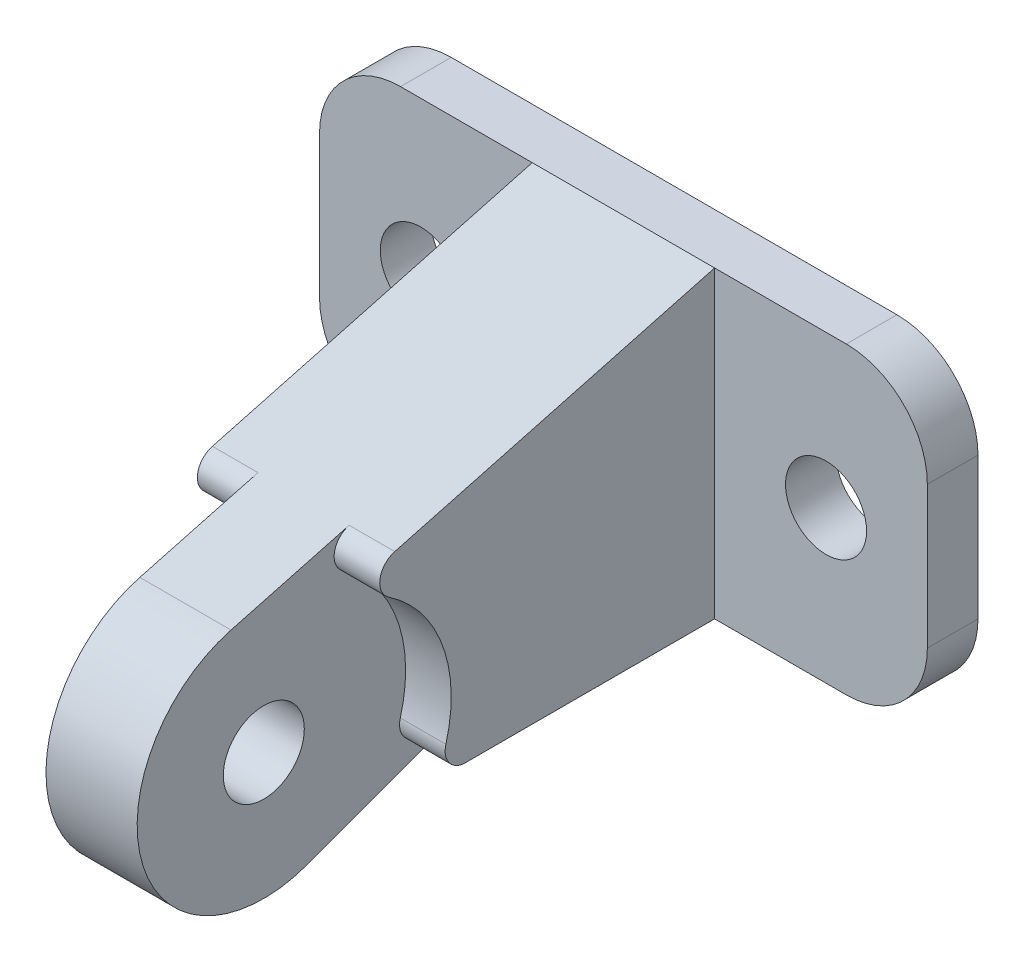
ISO-10303-21;
HEADER;
FILE_DESCRIPTION(('STEP AP214'),'2;1');
FILE_NAME('part.step','',(''),(''),'','','');
FILE_SCHEMA(('AUTOMOTIVE_DESIGN { 1 0 10303 214 1 1 1 1 }'));
ENDSEC;
DATA;
#1=APPLICATION_CONTEXT('core data for automotive mechanical design processes');
#2=APPLICATION_PROTOCOL_DEFINITION('international standard','automotive_design',2000,#1);
#3=PRODUCT_CONTEXT('',#1,'mechanical');
#4=PRODUCT('Part','Part','',(#3));
#5=PRODUCT_RELATED_PRODUCT_CATEGORY('part','',(#4));
#6=PRODUCT_DEFINITION_FORMATION('','',#4);
#7=PRODUCT_DEFINITION_CONTEXT('part definition',#1,'design');
#8=PRODUCT_DEFINITION('design','',#6,#7);
#9=PRODUCT_DEFINITION_SHAPE('','',#8);
#10=(LENGTH_UNIT() NAMED_UNIT(*) SI_UNIT(.MILLI.,.METRE.));
#11=(NAMED_UNIT(*) PLANE_ANGLE_UNIT() SI_UNIT($,.RADIAN.));
#12=(NAMED_UNIT(*) SI_UNIT($,.STERADIAN.) SOLID_ANGLE_UNIT());
#13=UNCERTAINTY_MEASURE_WITH_UNIT(LENGTH_MEASURE(1.E-05),#10,'distance_accuracy_value','');
#14=(GEOMETRIC_REPRESENTATION_CONTEXT(3) GLOBAL_UNCERTAINTY_ASSIGNED_CONTEXT((#13)) GLOBAL_UNIT_ASSIGNED_CONTEXT((#10,
#11,#12)) REPRESENTATION_CONTEXT('',''));
#15=CARTESIAN_POINT('',(0.,0.,0.));
#16=DIRECTION('',(0.,0.,1.));
#17=DIRECTION('',(1.,0.,0.));
#18=AXIS2_PLACEMENT_3D('',#15,#16,#17);
#19=CARTESIAN_POINT('',(22.,7.,5.));
#20=DIRECTION('',(0.,0.,-1.));
#21=DIRECTION('',(-1.,0.,0.));
#22=AXIS2_PLACEMENT_3D('',#19,#20,#21);
#23=PLANE('',#22);
#24=CARTESIAN_POINT('',(-20.,0.,5.));
#25=DIRECTION('',(0.,0.,1.));
#26=DIRECTION('',(1.,0.,0.));
#27=AXIS2_PLACEMENT_3D('',#24,#25,#26);
#28=CIRCLE('',#27,4.);
#29=CARTESIAN_POINT('',(-16.,0.,5.));
#30=VERTEX_POINT('',#29);
#31=EDGE_CURVE('E331',#30,#30,#28,.T.);
#32=ORIENTED_EDGE('',*,*,#31,.F.);
#33=EDGE_LOOP('',(#32));
#34=FACE_BOUND('',#33,.T.);
#35=DIRECTION('',(0.,-1.,0.));
#36=VECTOR('',#35,1.);
#37=CARTESIAN_POINT('',(-9.,0.,5.));
#38=LINE('',#37,#36);
#39=CARTESIAN_POINT('',(-9.,15.,5.));
#40=VERTEX_POINT('',#39);
#41=CARTESIAN_POINT('',(-9.,-15.,5.));
#42=VERTEX_POINT('',#41);
#43=EDGE_CURVE('E252',#40,#42,#38,.T.);
#44=ORIENTED_EDGE('',*,*,#43,.F.);
#45=DIRECTION('',(-1.,0.,0.));
#46=VECTOR('',#45,1.);
#47=CARTESIAN_POINT('',(-21.9999999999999,15.,5.));
#48=LINE('',#47,#46);
#49=CARTESIAN_POINT('',(-21.9999999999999,15.,5.));
#50=VERTEX_POINT('',#49);
#51=EDGE_CURVE('E343',#40,#50,#48,.T.);
#52=ORIENTED_EDGE('',*,*,#51,.T.);
#53=CARTESIAN_POINT('',(-22.,7.,5.));
#54=DIRECTION('',(0.,0.,1.));
#55=DIRECTION('',(-1.,0.,0.));
#56=AXIS2_PLACEMENT_3D('',#53,#54,#55);
#57=CIRCLE('',#56,8.);
#58=CARTESIAN_POINT('',(-30.,6.99999999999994,5.));
#59=VERTEX_POINT('',#58);
#60=EDGE_CURVE('E348',#50,#59,#57,.T.);
#61=ORIENTED_EDGE('',*,*,#60,.T.);
#62=DIRECTION('',(0.,-1.,0.));
#63=VECTOR('',#62,1.);
#64=CARTESIAN_POINT('',(-30.,-6.99999999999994,5.));
#65=LINE('',#64,#63);
#66=CARTESIAN_POINT('',(-30.,-6.99999999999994,5.));
#67=VERTEX_POINT('',#66);
#68=EDGE_CURVE('E351',#59,#67,#65,.T.);
#69=ORIENTED_EDGE('',*,*,#68,.T.);
#70=CARTESIAN_POINT('',(-22.,-7.,5.));
#71=DIRECTION('',(0.,0.,1.));
#72=DIRECTION('',(-1.,0.,0.));
#73=AXIS2_PLACEMENT_3D('',#70,#71,#72);
#74=CIRCLE('',#73,8.);
#75=CARTESIAN_POINT('',(-21.9999999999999,-15.,5.));
#76=VERTEX_POINT('',#75);
#77=EDGE_CURVE('E354',#67,#76,#74,.T.);
#78=ORIENTED_EDGE('',*,*,#77,.T.);
#79=DIRECTION('',(1.,0.,0.));
#80=VECTOR('',#79,1.);
#81=CARTESIAN_POINT('',(-21.9999999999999,-15.,5.));
#82=LINE('',#81,#80);
#83=EDGE_CURVE('E358',#76,#42,#82,.T.);
#84=ORIENTED_EDGE('',*,*,#83,.T.);
#85=EDGE_LOOP('',(#44,#52,#61,#69,#78,#84));
#86=FACE_BOUND('',#85,.T.);
#87=ADVANCED_FACE('F47',(#34,#86),#23,.F.);
#88=CARTESIAN_POINT('',(22.,15.,5.));
#89=VERTEX_POINT('',#88);
#90=CARTESIAN_POINT('',(9.,15.,5.));
#91=VERTEX_POINT('',#90);
#92=EDGE_CURVE('E345',#89,#91,#48,.T.);
#93=ORIENTED_EDGE('',*,*,#92,.T.);
#94=DIRECTION('',(0.,-1.,0.));
#95=VECTOR('',#94,1.);
#96=CARTESIAN_POINT('',(9.,0.,5.));
#97=LINE('',#96,#95);
#98=CARTESIAN_POINT('',(9.,-15.,5.));
#99=VERTEX_POINT('',#98);
#100=EDGE_CURVE('E70',#91,#99,#97,.T.);
#101=ORIENTED_EDGE('',*,*,#100,.T.);
#102=CARTESIAN_POINT('',(22.,-15.,5.));
#103=VERTEX_POINT('',#102);
#104=EDGE_CURVE('E357',#99,#103,#82,.T.);
#105=ORIENTED_EDGE('',*,*,#104,.T.);
#106=CARTESIAN_POINT('',(22.,-7.,5.));
#107=DIRECTION('',(0.,0.,1.));
#108=DIRECTION('',(-1.,0.,0.));
#109=AXIS2_PLACEMENT_3D('',#106,#107,#108);
#110=CIRCLE('',#109,8.);
#111=CARTESIAN_POINT('',(30.,-6.99999999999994,5.));
#112=VERTEX_POINT('',#111);
#113=EDGE_CURVE('E362',#103,#112,#110,.T.);
#114=ORIENTED_EDGE('',*,*,#113,.T.);
#115=DIRECTION('',(0.,1.,0.));
#116=VECTOR('',#115,1.);
#117=CARTESIAN_POINT('',(30.,-6.99999999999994,5.));
#118=LINE('',#117,#116);
#119=CARTESIAN_POINT('',(30.,6.99999999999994,5.));
#120=VERTEX_POINT('',#119);
#121=EDGE_CURVE('E365',#112,#120,#118,.T.);
#122=ORIENTED_EDGE('',*,*,#121,.T.);
#123=CARTESIAN_POINT('',(22.,7.,5.));
#124=DIRECTION('',(0.,0.,1.));
#125=DIRECTION('',(-1.,0.,0.));
#126=AXIS2_PLACEMENT_3D('',#123,#124,#125);
#127=CIRCLE('',#126,8.);
#128=EDGE_CURVE('E339',#120,#89,#127,.T.);
#129=ORIENTED_EDGE('',*,*,#128,.T.);
#130=EDGE_LOOP('',(#93,#101,#105,#114,#122,#129));
#131=FACE_BOUND('',#130,.T.);
#132=CARTESIAN_POINT('',(20.,0.,5.));
#133=DIRECTION('',(0.,0.,1.));
#134=DIRECTION('',(1.,0.,0.));
#135=AXIS2_PLACEMENT_3D('',#132,#133,#134);
#136=CIRCLE('',#135,4.);
#137=CARTESIAN_POINT('',(24.,0.,5.));
#138=VERTEX_POINT('',#137);
#139=EDGE_CURVE('E323',#138,#138,#136,.T.);
#140=ORIENTED_EDGE('',*,*,#139,.F.);
#141=EDGE_LOOP('',(#140));
#142=FACE_BOUND('',#141,.T.);
#143=ADVANCED_FACE('F515',(#131,#142),#23,.F.);
#144=CARTESIAN_POINT('',(22.,7.,0.));
#145=DIRECTION('',(0.,0.,-1.));
#146=DIRECTION('',(-1.,0.,0.));
#147=AXIS2_PLACEMENT_3D('',#144,#145,#146);
#148=PLANE('',#147);
#149=CARTESIAN_POINT('',(-20.,0.,0.));
#150=DIRECTION('',(0.,0.,1.));
#151=DIRECTION('',(1.,0.,0.));
#152=AXIS2_PLACEMENT_3D('',#149,#150,#151);
#153=CIRCLE('',#152,4.);
#154=CARTESIAN_POINT('',(-16.,0.,0.));
#155=VERTEX_POINT('',#154);
#156=EDGE_CURVE('E327',#155,#155,#153,.T.);
#157=ORIENTED_EDGE('',*,*,#156,.T.);
#158=EDGE_LOOP('',(#157));
#159=FACE_BOUND('',#158,.T.);
#160=CARTESIAN_POINT('',(22.,7.,0.));
#161=DIRECTION('',(0.,0.,1.));
#162=DIRECTION('',(-1.,0.,0.));
#163=AXIS2_PLACEMENT_3D('',#160,#161,#162);
#164=CIRCLE('',#163,8.);
#165=CARTESIAN_POINT('',(30.,6.99999999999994,0.));
#166=VERTEX_POINT('',#165);
#167=CARTESIAN_POINT('',(22.,15.,0.));
#168=VERTEX_POINT('',#167);
#169=EDGE_CURVE('E335',#166,#168,#164,.T.);
#170=ORIENTED_EDGE('',*,*,#169,.F.);
#171=DIRECTION('',(0.,1.,0.));
#172=VECTOR('',#171,1.);
#173=CARTESIAN_POINT('',(30.,-6.99999999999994,0.));
#174=LINE('',#173,#172);
#175=CARTESIAN_POINT('',(30.,-6.99999999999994,0.));
#176=VERTEX_POINT('',#175);
#177=EDGE_CURVE('E344',#176,#166,#174,.T.);
#178=ORIENTED_EDGE('',*,*,#177,.F.);
#179=CARTESIAN_POINT('',(22.,-7.,0.));
#180=DIRECTION('',(0.,0.,1.));
#181=DIRECTION('',(-1.,0.,0.));
#182=AXIS2_PLACEMENT_3D('',#179,#180,#181);
#183=CIRCLE('',#182,8.);
#184=CARTESIAN_POINT('',(22.,-15.,0.));
#185=VERTEX_POINT('',#184);
#186=EDGE_CURVE('E387',#185,#176,#183,.T.);
#187=ORIENTED_EDGE('',*,*,#186,.F.);
#188=DIRECTION('',(1.,0.,0.));
#189=VECTOR('',#188,1.);
#190=CARTESIAN_POINT('',(-21.9999999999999,-15.,0.));
#191=LINE('',#190,#189);
#192=CARTESIAN_POINT('',(-21.9999999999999,-15.,0.));
#193=VERTEX_POINT('',#192);
#194=EDGE_CURVE('E384',#193,#185,#191,.T.);
#195=ORIENTED_EDGE('',*,*,#194,.F.);
#196=CARTESIAN_POINT('',(-22.,-7.,0.));
#197=DIRECTION('',(0.,0.,1.));
#198=DIRECTION('',(-1.,0.,0.));
#199=AXIS2_PLACEMENT_3D('',#196,#197,#198);
#200=CIRCLE('',#199,8.);
#201=CARTESIAN_POINT('',(-30.,-6.99999999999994,0.));
#202=VERTEX_POINT('',#201);
#203=EDGE_CURVE('E381',#202,#193,#200,.T.);
#204=ORIENTED_EDGE('',*,*,#203,.F.);
#205=DIRECTION('',(0.,-1.,0.));
#206=VECTOR('',#205,1.);
#207=CARTESIAN_POINT('',(-30.,-6.99999999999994,0.));
#208=LINE('',#207,#206);
#209=CARTESIAN_POINT('',(-30.,6.99999999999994,0.));
#210=VERTEX_POINT('',#209);
#211=EDGE_CURVE('E378',#210,#202,#208,.T.);
#212=ORIENTED_EDGE('',*,*,#211,.F.);
#213=CARTESIAN_POINT('',(-22.,7.,0.));
#214=DIRECTION('',(0.,0.,1.));
#215=DIRECTION('',(-1.,0.,0.));
#216=AXIS2_PLACEMENT_3D('',#213,#214,#215);
#217=CIRCLE('',#216,8.);
#218=CARTESIAN_POINT('',(-21.9999999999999,15.,0.));
#219=VERTEX_POINT('',#218);
#220=EDGE_CURVE('E375',#219,#210,#217,.T.);
#221=ORIENTED_EDGE('',*,*,#220,.F.);
#222=DIRECTION('',(-1.,0.,0.));
#223=VECTOR('',#222,1.);
#224=CARTESIAN_POINT('',(-21.9999999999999,15.,0.));
#225=LINE('',#224,#223);
#226=EDGE_CURVE('E372',#168,#219,#225,.T.);
#227=ORIENTED_EDGE('',*,*,#226,.F.);
#228=EDGE_LOOP('',(#170,#178,#187,#195,#204,#212,#221,#227));
#229=FACE_BOUND('',#228,.T.);
#230=CARTESIAN_POINT('',(20.,0.,0.));
#231=DIRECTION('',(0.,0.,1.));
#232=DIRECTION('',(1.,0.,0.));
#233=AXIS2_PLACEMENT_3D('',#230,#231,#232);
#234=CIRCLE('',#233,4.);
#235=CARTESIAN_POINT('',(24.,0.,0.));
#236=VERTEX_POINT('',#235);
#237=EDGE_CURVE('E322',#236,#236,#234,.T.);
#238=ORIENTED_EDGE('',*,*,#237,.T.);
#239=EDGE_LOOP('',(#238));
#240=FACE_BOUND('',#239,.T.);
#241=ADVANCED_FACE('F504',(#159,#229,#240),#148,.T.);
#242=CARTESIAN_POINT('',(22.,7.,5.));
#243=DIRECTION('',(0.,0.,-1.));
#244=DIRECTION('',(-1.,0.,0.));
#245=AXIS2_PLACEMENT_3D('',#242,#243,#244);
#246=CYLINDRICAL_SURFACE('',#245,8.);
#247=ORIENTED_EDGE('',*,*,#169,.T.);
#248=DIRECTION('',(0.,0.,-1.));
#249=VECTOR('',#248,1.);
#250=CARTESIAN_POINT('',(22.,15.,5.));
#251=LINE('',#250,#249);
#252=EDGE_CURVE('E419',#89,#168,#251,.T.);
#253=ORIENTED_EDGE('',*,*,#252,.F.);
#254=ORIENTED_EDGE('',*,*,#128,.F.);
#255=DIRECTION('',(0.,0.,-1.));
#256=VECTOR('',#255,1.);
#257=CARTESIAN_POINT('',(30.,6.99999999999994,5.));
#258=LINE('',#257,#256);
#259=EDGE_CURVE('E368',#120,#166,#258,.T.);
#260=ORIENTED_EDGE('',*,*,#259,.T.);
#261=EDGE_LOOP('',(#247,#253,#254,#260));
#262=FACE_BOUND('',#261,.T.);
#263=ADVANCED_FACE('F49',(#262),#246,.T.);
#264=CARTESIAN_POINT('',(-21.9999999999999,15.,5.));
#265=DIRECTION('',(0.,-1.,0.));
#266=DIRECTION('',(0.,0.,-1.));
#267=AXIS2_PLACEMENT_3D('',#264,#265,#266);
#268=PLANE('',#267);
#269=ORIENTED_EDGE('',*,*,#226,.T.);
#270=DIRECTION('',(0.,0.,-1.));
#271=VECTOR('',#270,1.);
#272=CARTESIAN_POINT('',(-21.9999999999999,15.,5.));
#273=LINE('',#272,#271);
#274=EDGE_CURVE('E415',#50,#219,#273,.T.);
#275=ORIENTED_EDGE('',*,*,#274,.F.);
#276=ORIENTED_EDGE('',*,*,#51,.F.);
#277=EDGE_CURVE('E63',#91,#40,#48,.T.);
#278=ORIENTED_EDGE('',*,*,#277,.F.);
#279=ORIENTED_EDGE('',*,*,#92,.F.);
#280=ORIENTED_EDGE('',*,*,#252,.T.);
#281=EDGE_LOOP('',(#269,#275,#276,#278,#279,#280));
#282=FACE_BOUND('',#281,.T.);
#283=ADVANCED_FACE('F486',(#282),#268,.F.);
#284=CARTESIAN_POINT('',(-22.,7.,5.));
#285=DIRECTION('',(0.,0.,-1.));
#286=DIRECTION('',(-1.,0.,0.));
#287=AXIS2_PLACEMENT_3D('',#284,#285,#286);
#288=CYLINDRICAL_SURFACE('',#287,8.);
#289=ORIENTED_EDGE('',*,*,#220,.T.);
#290=DIRECTION('',(0.,0.,-1.));
#291=VECTOR('',#290,1.);
#292=CARTESIAN_POINT('',(-30.,6.99999999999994,5.));
#293=LINE('',#292,#291);
#294=EDGE_CURVE('E411',#59,#210,#293,.T.);
#295=ORIENTED_EDGE('',*,*,#294,.F.);
#296=ORIENTED_EDGE('',*,*,#60,.F.);
#297=ORIENTED_EDGE('',*,*,#274,.T.);
#298=EDGE_LOOP('',(#289,#295,#296,#297));
#299=FACE_BOUND('',#298,.T.);
#300=ADVANCED_FACE('F489',(#299),#288,.T.);
#301=CARTESIAN_POINT('',(-30.,-6.99999999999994,5.));
#302=DIRECTION('',(1.,0.,0.));
#303=DIRECTION('',(0.,0.,-1.));
#304=AXIS2_PLACEMENT_3D('',#301,#302,#303);
#305=PLANE('',#304);
#306=ORIENTED_EDGE('',*,*,#211,.T.);
#307=DIRECTION('',(0.,0.,-1.));
#308=VECTOR('',#307,1.);
#309=CARTESIAN_POINT('',(-30.,-6.99999999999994,5.));
#310=LINE('',#309,#308);
#311=EDGE_CURVE('E407',#67,#202,#310,.T.);
#312=ORIENTED_EDGE('',*,*,#311,.F.);
#313=ORIENTED_EDGE('',*,*,#68,.F.);
#314=ORIENTED_EDGE('',*,*,#294,.T.);
#315=EDGE_LOOP('',(#306,#312,#313,#314));
#316=FACE_BOUND('',#315,.T.);
#317=ADVANCED_FACE('F494',(#316),#305,.F.);
#318=CARTESIAN_POINT('',(-22.,-7.,5.));
#319=DIRECTION('',(0.,0.,-1.));
#320=DIRECTION('',(-1.,0.,0.));
#321=AXIS2_PLACEMENT_3D('',#318,#319,#320);
#322=CYLINDRICAL_SURFACE('',#321,8.);
#323=ORIENTED_EDGE('',*,*,#203,.T.);
#324=DIRECTION('',(0.,0.,-1.));
#325=VECTOR('',#324,1.);
#326=CARTESIAN_POINT('',(-21.9999999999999,-15.,5.));
#327=LINE('',#326,#325);
#328=EDGE_CURVE('E403',#76,#193,#327,.T.);
#329=ORIENTED_EDGE('',*,*,#328,.F.);
#330=ORIENTED_EDGE('',*,*,#77,.F.);
#331=ORIENTED_EDGE('',*,*,#311,.T.);
#332=EDGE_LOOP('',(#323,#329,#330,#331));
#333=FACE_BOUND('',#332,.T.);
#334=ADVANCED_FACE('F498',(#333),#322,.T.);
#335=CARTESIAN_POINT('',(-21.9999999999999,-15.,5.));
#336=DIRECTION('',(0.,1.,0.));
#337=DIRECTION('',(0.,0.,1.));
#338=AXIS2_PLACEMENT_3D('',#335,#336,#337);
#339=PLANE('',#338);
#340=ORIENTED_EDGE('',*,*,#104,.F.);
#341=DIRECTION('',(0.,0.,1.));
#342=VECTOR('',#341,1.);
#343=CARTESIAN_POINT('',(9.,-15.,0.));
#344=LINE('',#343,#342);
#345=CARTESIAN_POINT('',(9.,-15.,29.6001615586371));
#346=VERTEX_POINT('',#345);
#347=EDGE_CURVE('E225',#99,#346,#344,.T.);
#348=ORIENTED_EDGE('',*,*,#347,.T.);
#349=DIRECTION('',(-1.,0.,0.));
#350=VECTOR('',#349,1.);
#351=CARTESIAN_POINT('',(9.,-15.,29.6001615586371));
#352=LINE('',#351,#350);
#353=CARTESIAN_POINT('',(4.5,-15.,29.6001615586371));
#354=VERTEX_POINT('',#353);
#355=EDGE_CURVE('E263',#346,#354,#352,.T.);
#356=ORIENTED_EDGE('',*,*,#355,.T.);
#357=DIRECTION('',(0.,0.,-1.));
#358=VECTOR('',#357,1.);
#359=CARTESIAN_POINT('',(4.5,-15.,0.));
#360=LINE('',#359,#358);
#361=CARTESIAN_POINT('',(4.5,-15.,25.9137657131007));
#362=VERTEX_POINT('',#361);
#363=EDGE_CURVE('E203',#354,#362,#360,.T.);
#364=ORIENTED_EDGE('',*,*,#363,.T.);
#365=DIRECTION('',(-1.,0.,0.));
#366=VECTOR('',#365,1.);
#367=CARTESIAN_POINT('',(4.5,-15.,25.9137657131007));
#368=LINE('',#367,#366);
#369=CARTESIAN_POINT('',(-4.5,-15.,25.9137657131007));
#370=VERTEX_POINT('',#369);
#371=EDGE_CURVE('E298',#362,#370,#368,.T.);
#372=ORIENTED_EDGE('',*,*,#371,.T.);
#373=DIRECTION('',(0.,0.,-1.));
#374=VECTOR('',#373,1.);
#375=CARTESIAN_POINT('',(-4.5,-15.,0.));
#376=LINE('',#375,#374);
#377=CARTESIAN_POINT('',(-4.5,-15.,29.6001615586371));
#378=VERTEX_POINT('',#377);
#379=EDGE_CURVE('E423',#378,#370,#376,.T.);
#380=ORIENTED_EDGE('',*,*,#379,.F.);
#381=CARTESIAN_POINT('',(-9.,-15.,29.6001615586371));
#382=VERTEX_POINT('',#381);
#383=EDGE_CURVE('E262',#378,#382,#352,.T.);
#384=ORIENTED_EDGE('',*,*,#383,.T.);
#385=DIRECTION('',(0.,0.,1.));
#386=VECTOR('',#385,1.);
#387=CARTESIAN_POINT('',(-9.,-15.,0.));
#388=LINE('',#387,#386);
#389=EDGE_CURVE('E248',#42,#382,#388,.T.);
#390=ORIENTED_EDGE('',*,*,#389,.F.);
#391=ORIENTED_EDGE('',*,*,#83,.F.);
#392=ORIENTED_EDGE('',*,*,#328,.T.);
#393=ORIENTED_EDGE('',*,*,#194,.T.);
#394=DIRECTION('',(0.,0.,-1.));
#395=VECTOR('',#394,1.);
#396=CARTESIAN_POINT('',(22.,-15.,5.));
#397=LINE('',#396,#395);
#398=EDGE_CURVE('E399',#103,#185,#397,.T.);
#399=ORIENTED_EDGE('',*,*,#398,.F.);
#400=EDGE_LOOP('',(#340,#348,#356,#364,#372,#380,#384,#390,#391,#392,#393,#399));
#401=FACE_BOUND('',#400,.T.);
#402=ADVANCED_FACE('F459',(#401),#339,.F.);
#403=CARTESIAN_POINT('',(22.,-7.,5.));
#404=DIRECTION('',(0.,0.,-1.));
#405=DIRECTION('',(-1.,0.,0.));
#406=AXIS2_PLACEMENT_3D('',#403,#404,#405);
#407=CYLINDRICAL_SURFACE('',#406,8.);
#408=ORIENTED_EDGE('',*,*,#186,.T.);
#409=DIRECTION('',(0.,0.,-1.));
#410=VECTOR('',#409,1.);
#411=CARTESIAN_POINT('',(30.,-6.99999999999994,5.));
#412=LINE('',#411,#410);
#413=EDGE_CURVE('E395',#112,#176,#412,.T.);
#414=ORIENTED_EDGE('',*,*,#413,.F.);
#415=ORIENTED_EDGE('',*,*,#113,.F.);
#416=ORIENTED_EDGE('',*,*,#398,.T.);
#417=EDGE_LOOP('',(#408,#414,#415,#416));
#418=FACE_BOUND('',#417,.T.);
#419=ADVANCED_FACE('F509',(#418),#407,.T.);
#420=CARTESIAN_POINT('',(30.,-6.99999999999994,5.));
#421=DIRECTION('',(-1.,0.,0.));
#422=DIRECTION('',(0.,0.,1.));
#423=AXIS2_PLACEMENT_3D('',#420,#421,#422);
#424=PLANE('',#423);
#425=ORIENTED_EDGE('',*,*,#177,.T.);
#426=ORIENTED_EDGE('',*,*,#259,.F.);
#427=ORIENTED_EDGE('',*,*,#121,.F.);
#428=ORIENTED_EDGE('',*,*,#413,.T.);
#429=EDGE_LOOP('',(#425,#426,#427,#428));
#430=FACE_BOUND('',#429,.T.);
#431=ADVANCED_FACE('F512',(#430),#424,.F.);
#432=CARTESIAN_POINT('',(-20.,0.,5.));
#433=DIRECTION('',(0.,0.,-1.));
#434=DIRECTION('',(-1.,0.,0.));
#435=AXIS2_PLACEMENT_3D('',#432,#433,#434);
#436=CYLINDRICAL_SURFACE('',#435,4.);
#437=ORIENTED_EDGE('',*,*,#31,.T.);
#438=EDGE_LOOP('',(#437));
#439=FACE_BOUND('',#438,.T.);
#440=ORIENTED_EDGE('',*,*,#156,.F.);
#441=EDGE_LOOP('',(#440));
#442=FACE_BOUND('',#441,.T.);
#443=ADVANCED_FACE('F536',(#439,#442),#436,.F.);
#444=CARTESIAN_POINT('',(20.,0.,5.));
#445=DIRECTION('',(0.,0.,-1.));
#446=DIRECTION('',(-1.,0.,0.));
#447=AXIS2_PLACEMENT_3D('',#444,#445,#446);
#448=CYLINDRICAL_SURFACE('',#447,4.);
#449=ORIENTED_EDGE('',*,*,#139,.T.);
#450=EDGE_LOOP('',(#449));
#451=FACE_BOUND('',#450,.T.);
#452=ORIENTED_EDGE('',*,*,#237,.F.);
#453=EDGE_LOOP('',(#452));
#454=FACE_BOUND('',#453,.T.);
#455=ADVANCED_FACE('F580',(#451,#454),#448,.F.);
#456=CARTESIAN_POINT('',(4.5,15.2451905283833,4.0849364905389));
#457=DIRECTION('',(0.,-0.965925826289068,-0.258819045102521));
#458=DIRECTION('',(0.,0.258819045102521,-0.965925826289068));
#459=AXIS2_PLACEMENT_3D('',#456,#457,#458);
#460=PLANE('',#459);
#461=DIRECTION('',(0.,-0.258819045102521,0.965925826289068));
#462=VECTOR('',#461,1.);
#463=CARTESIAN_POINT('',(4.5,15.2451905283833,4.0849364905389));
#464=LINE('',#463,#462);
#465=CARTESIAN_POINT('',(4.5,6.53979664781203,36.5739087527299));
#466=VERTEX_POINT('',#465);
#467=CARTESIAN_POINT('',(4.5,3.41515287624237,48.2352380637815));
#468=VERTEX_POINT('',#467);
#469=EDGE_CURVE('E283',#466,#468,#464,.T.);
#470=ORIENTED_EDGE('',*,*,#469,.F.);
#471=DIRECTION('',(-1.,0.,0.));
#472=VECTOR('',#471,1.);
#473=CARTESIAN_POINT('',(9.,6.53979664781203,36.5739087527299));
#474=LINE('',#473,#472);
#475=CARTESIAN_POINT('',(9.,6.53979664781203,36.5739087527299));
#476=VERTEX_POINT('',#475);
#477=EDGE_CURVE('E259',#476,#466,#474,.T.);
#478=ORIENTED_EDGE('',*,*,#477,.F.);
#479=DIRECTION('',(0.,-0.258819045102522,0.965925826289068));
#480=VECTOR('',#479,1.);
#481=CARTESIAN_POINT('',(9.,15.2451905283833,4.08493649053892));
#482=LINE('',#481,#480);
#483=EDGE_CURVE('E213',#91,#476,#482,.T.);
#484=ORIENTED_EDGE('',*,*,#483,.F.);
#485=ORIENTED_EDGE('',*,*,#277,.T.);
#486=DIRECTION('',(0.,-0.258819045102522,0.965925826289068));
#487=VECTOR('',#486,1.);
#488=CARTESIAN_POINT('',(-9.,15.2451905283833,4.08493649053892));
#489=LINE('',#488,#487);
#490=CARTESIAN_POINT('',(-9.,6.53979664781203,36.5739087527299));
#491=VERTEX_POINT('',#490);
#492=EDGE_CURVE('E216',#40,#491,#489,.T.);
#493=ORIENTED_EDGE('',*,*,#492,.T.);
#494=CARTESIAN_POINT('',(-4.5,6.53979664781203,36.5739087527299));
#495=VERTEX_POINT('',#494);
#496=EDGE_CURVE('E235',#495,#491,#474,.T.);
#497=ORIENTED_EDGE('',*,*,#496,.F.);
#498=DIRECTION('',(0.,-0.258819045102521,0.965925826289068));
#499=VECTOR('',#498,1.);
#500=CARTESIAN_POINT('',(-4.5,15.2451905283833,4.0849364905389));
#501=LINE('',#500,#499);
#502=CARTESIAN_POINT('',(-4.5,3.41515287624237,48.2352380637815));
#503=VERTEX_POINT('',#502);
#504=EDGE_CURVE('E282',#495,#503,#501,.T.);
#505=ORIENTED_EDGE('',*,*,#504,.T.);
#506=DIRECTION('',(-1.,0.,0.));
#507=VECTOR('',#506,1.);
#508=CARTESIAN_POINT('',(4.5,3.41515287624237,48.2352380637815));
#509=LINE('',#508,#507);
#510=EDGE_CURVE('E318',#468,#503,#509,.T.);
#511=ORIENTED_EDGE('',*,*,#510,.F.);
#512=EDGE_LOOP('',(#470,#478,#484,#485,#493,#497,#505,#511));
#513=FACE_BOUND('',#512,.T.);
#514=ADVANCED_FACE('F450',(#513),#460,.F.);
#515=CARTESIAN_POINT('',(4.5,-8.65891995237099,45.));
#516=DIRECTION('',(-1.,0.,0.));
#517=DIRECTION('',(0.,0.,1.));
#518=AXIS2_PLACEMENT_3D('',#515,#516,#517);
#519=CYLINDRICAL_SURFACE('',#518,12.5);
#520=CARTESIAN_POINT('',(-4.5,-8.65891995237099,45.));
#521=DIRECTION('',(1.,0.,0.));
#522=DIRECTION('',(0.,0.,-1.));
#523=AXIS2_PLACEMENT_3D('',#520,#521,#522);
#524=CIRCLE('',#523,12.5);
#525=CARTESIAN_POINT('',(-4.5,-20.4014230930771,40.7147205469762));
#526=VERTEX_POINT('',#525);
#527=EDGE_CURVE('E301',#503,#526,#524,.T.);
#528=ORIENTED_EDGE('',*,*,#527,.T.);
#529=DIRECTION('',(-1.,0.,0.));
#530=VECTOR('',#529,1.);
#531=CARTESIAN_POINT('',(4.5,-20.4014230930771,40.7147205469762));
#532=LINE('',#531,#530);
#533=CARTESIAN_POINT('',(4.5,-20.4014230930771,40.7147205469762));
#534=VERTEX_POINT('',#533);
#535=EDGE_CURVE('E315',#534,#526,#532,.T.);
#536=ORIENTED_EDGE('',*,*,#535,.F.);
#537=CARTESIAN_POINT('',(4.5,-8.65891995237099,45.));
#538=DIRECTION('',(1.,0.,0.));
#539=DIRECTION('',(0.,0.,-1.));
#540=AXIS2_PLACEMENT_3D('',#537,#538,#539);
#541=CIRCLE('',#540,12.5);
#542=EDGE_CURVE('E286',#468,#534,#541,.T.);
#543=ORIENTED_EDGE('',*,*,#542,.F.);
#544=ORIENTED_EDGE('',*,*,#510,.T.);
#545=EDGE_LOOP('',(#528,#536,#543,#544));
#546=FACE_BOUND('',#545,.T.);
#547=ADVANCED_FACE('F469',(#546),#519,.T.);
#548=CARTESIAN_POINT('',(4.5,-4.8916314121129,-1.78513961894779));
#549=DIRECTION('',(0.,-0.939400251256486,-0.342822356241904));
#550=DIRECTION('',(0.,0.342822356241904,-0.939400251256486));
#551=AXIS2_PLACEMENT_3D('',#548,#549,#550);
#552=PLANE('',#551);
#553=DIRECTION('',(0.,-0.342822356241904,0.939400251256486));
#554=VECTOR('',#553,1.);
#555=CARTESIAN_POINT('',(-4.5,-4.8916314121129,-1.78513961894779));
#556=LINE('',#555,#554);
#557=EDGE_CURVE('E305',#370,#526,#556,.T.);
#558=ORIENTED_EDGE('',*,*,#557,.F.);
#559=ORIENTED_EDGE('',*,*,#371,.F.);
#560=DIRECTION('',(0.,-0.342822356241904,0.939400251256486));
#561=VECTOR('',#560,1.);
#562=CARTESIAN_POINT('',(4.5,-4.8916314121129,-1.78513961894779));
#563=LINE('',#562,#561);
#564=EDGE_CURVE('E290',#362,#534,#563,.T.);
#565=ORIENTED_EDGE('',*,*,#564,.T.);
#566=ORIENTED_EDGE('',*,*,#535,.T.);
#567=EDGE_LOOP('',(#558,#559,#565,#566));
#568=FACE_BOUND('',#567,.T.);
#569=ADVANCED_FACE('F464',(#568),#552,.T.);
#570=CARTESIAN_POINT('',(4.5,-8.65891995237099,45.));
#571=DIRECTION('',(-1.,0.,0.));
#572=DIRECTION('',(0.,0.,1.));
#573=AXIS2_PLACEMENT_3D('',#570,#571,#572);
#574=CYLINDRICAL_SURFACE('',#573,4.00000000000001);
#575=CARTESIAN_POINT('',(4.5,-8.65891995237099,45.));
#576=DIRECTION('',(1.,0.,0.));
#577=DIRECTION('',(0.,0.,-1.));
#578=AXIS2_PLACEMENT_3D('',#575,#576,#577);
#579=CIRCLE('',#578,4.00000000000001);
#580=CARTESIAN_POINT('',(4.5,-8.65891995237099,41.));
#581=VERTEX_POINT('',#580);
#582=EDGE_CURVE('E294',#581,#581,#579,.T.);
#583=ORIENTED_EDGE('',*,*,#582,.T.);
#584=EDGE_LOOP('',(#583));
#585=FACE_BOUND('',#584,.T.);
#586=CARTESIAN_POINT('',(-4.5,-8.65891995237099,45.));
#587=DIRECTION('',(1.,0.,0.));
#588=DIRECTION('',(0.,0.,-1.));
#589=AXIS2_PLACEMENT_3D('',#586,#587,#588);
#590=CIRCLE('',#589,4.00000000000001);
#591=CARTESIAN_POINT('',(-4.5,-8.65891995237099,41.));
#592=VERTEX_POINT('',#591);
#593=EDGE_CURVE('E287',#592,#592,#590,.T.);
#594=ORIENTED_EDGE('',*,*,#593,.F.);
#595=EDGE_LOOP('',(#594));
#596=FACE_BOUND('',#595,.T.);
#597=ADVANCED_FACE('F601',(#585,#596),#574,.F.);
#598=CARTESIAN_POINT('',(4.5,0.,0.));
#599=DIRECTION('',(1.,0.,0.));
#600=DIRECTION('',(0.,0.,-1.));
#601=AXIS2_PLACEMENT_3D('',#598,#599,#600);
#602=PLANE('',#601);
#603=CARTESIAN_POINT('',(4.5,4.60794499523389,36.0562706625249));
#604=DIRECTION('',(1.,0.,0.));
#605=DIRECTION('',(0.,0.,-1.));
#606=AXIS2_PLACEMENT_3D('',#603,#604,#605);
#607=CIRCLE('',#606,2.);
#608=CARTESIAN_POINT('',(4.5,2.94958687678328,37.1742368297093));
#609=VERTEX_POINT('',#608);
#610=EDGE_CURVE('E198',#466,#609,#607,.T.);
#611=ORIENTED_EDGE('',*,*,#610,.F.);
#612=ORIENTED_EDGE('',*,*,#469,.T.);
#613=ORIENTED_EDGE('',*,*,#542,.T.);
#614=ORIENTED_EDGE('',*,*,#564,.F.);
#615=ORIENTED_EDGE('',*,*,#363,.F.);
#616=CARTESIAN_POINT('',(4.5,-13.,29.6001615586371));
#617=DIRECTION('',(1.,0.,0.));
#618=DIRECTION('',(0.,0.,-1.));
#619=AXIS2_PLACEMENT_3D('',#616,#617,#618);
#620=CIRCLE('',#619,2.);
#621=CARTESIAN_POINT('',(4.5,-12.4573649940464,31.5251413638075));
#622=VERTEX_POINT('',#621);
#623=EDGE_CURVE('E273',#622,#354,#620,.T.);
#624=ORIENTED_EDGE('',*,*,#623,.F.);
#625=CARTESIAN_POINT('',(4.5,-8.65891995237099,45.));
#626=DIRECTION('',(1.,0.,0.));
#627=DIRECTION('',(0.,0.,-1.));
#628=AXIS2_PLACEMENT_3D('',#625,#626,#627);
#629=CIRCLE('',#628,14.);
#630=EDGE_CURVE('E277',#609,#622,#629,.F.);
#631=ORIENTED_EDGE('',*,*,#630,.F.);
#632=EDGE_LOOP('',(#611,#612,#613,#614,#615,#624,#631));
#633=FACE_BOUND('',#632,.T.);
#634=ORIENTED_EDGE('',*,*,#582,.F.);
#635=EDGE_LOOP('',(#634));
#636=FACE_BOUND('',#635,.T.);
#637=ADVANCED_FACE('F472',(#633,#636),#602,.T.);
#638=CARTESIAN_POINT('',(-4.5,0.,0.));
#639=DIRECTION('',(1.,0.,0.));
#640=DIRECTION('',(0.,0.,-1.));
#641=AXIS2_PLACEMENT_3D('',#638,#639,#640);
#642=PLANE('',#641);
#643=ORIENTED_EDGE('',*,*,#504,.F.);
#644=CARTESIAN_POINT('',(-4.5,4.60794499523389,36.0562706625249));
#645=DIRECTION('',(1.,0.,0.));
#646=DIRECTION('',(0.,0.,-1.));
#647=AXIS2_PLACEMENT_3D('',#644,#645,#646);
#648=CIRCLE('',#647,2.);
#649=CARTESIAN_POINT('',(-4.5,2.94958687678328,37.1742368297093));
#650=VERTEX_POINT('',#649);
#651=EDGE_CURVE('E11',#495,#650,#648,.T.);
#652=ORIENTED_EDGE('',*,*,#651,.T.);
#653=CARTESIAN_POINT('',(-4.5,-8.65891995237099,45.));
#654=DIRECTION('',(1.,0.,0.));
#655=DIRECTION('',(0.,0.,-1.));
#656=AXIS2_PLACEMENT_3D('',#653,#654,#655);
#657=CIRCLE('',#656,14.);
#658=CARTESIAN_POINT('',(-4.5,-12.4573649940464,31.5251413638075));
#659=VERTEX_POINT('',#658);
#660=EDGE_CURVE('E56',#650,#659,#657,.F.);
#661=ORIENTED_EDGE('',*,*,#660,.T.);
#662=CARTESIAN_POINT('',(-4.5,-13.,29.6001615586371));
#663=DIRECTION('',(1.,0.,0.));
#664=DIRECTION('',(0.,0.,-1.));
#665=AXIS2_PLACEMENT_3D('',#662,#663,#664);
#666=CIRCLE('',#665,2.);
#667=EDGE_CURVE('E426',#659,#378,#666,.T.);
#668=ORIENTED_EDGE('',*,*,#667,.T.);
#669=ORIENTED_EDGE('',*,*,#379,.T.);
#670=ORIENTED_EDGE('',*,*,#557,.T.);
#671=ORIENTED_EDGE('',*,*,#527,.F.);
#672=EDGE_LOOP('',(#643,#652,#661,#668,#669,#670,#671));
#673=FACE_BOUND('',#672,.T.);
#674=ORIENTED_EDGE('',*,*,#593,.T.);
#675=EDGE_LOOP('',(#674));
#676=FACE_BOUND('',#675,.T.);
#677=ADVANCED_FACE('F433',(#673,#676),#642,.F.);
#678=CARTESIAN_POINT('',(9.,-13.,29.6001615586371));
#679=DIRECTION('',(-1.,0.,0.));
#680=DIRECTION('',(0.,0.,1.));
#681=AXIS2_PLACEMENT_3D('',#678,#679,#680);
#682=CYLINDRICAL_SURFACE('',#681,2.);
#683=ORIENTED_EDGE('',*,*,#667,.F.);
#684=DIRECTION('',(-1.,0.,0.));
#685=VECTOR('',#684,1.);
#686=CARTESIAN_POINT('',(9.,-12.4573649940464,31.5251413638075));
#687=LINE('',#686,#685);
#688=CARTESIAN_POINT('',(-9.,-12.4573649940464,31.5251413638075));
#689=VERTEX_POINT('',#688);
#690=EDGE_CURVE('E267',#659,#689,#687,.T.);
#691=ORIENTED_EDGE('',*,*,#690,.T.);
#692=CARTESIAN_POINT('',(-9.,-13.,29.6001615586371));
#693=DIRECTION('',(1.,0.,0.));
#694=DIRECTION('',(0.,0.,-1.));
#695=AXIS2_PLACEMENT_3D('',#692,#693,#694);
#696=CIRCLE('',#695,2.);
#697=EDGE_CURVE('E244',#382,#689,#696,.F.);
#698=ORIENTED_EDGE('',*,*,#697,.F.);
#699=ORIENTED_EDGE('',*,*,#383,.F.);
#700=EDGE_LOOP('',(#683,#691,#698,#699));
#701=FACE_BOUND('',#700,.T.);
#702=ADVANCED_FACE('F457',(#701),#682,.T.);
#703=CARTESIAN_POINT('',(9.,-8.65891995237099,45.));
#704=DIRECTION('',(-1.,0.,0.));
#705=DIRECTION('',(0.,0.,1.));
#706=AXIS2_PLACEMENT_3D('',#703,#704,#705);
#707=CYLINDRICAL_SURFACE('',#706,14.);
#708=ORIENTED_EDGE('',*,*,#660,.F.);
#709=DIRECTION('',(-1.,0.,0.));
#710=VECTOR('',#709,1.);
#711=CARTESIAN_POINT('',(9.,2.94958687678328,37.1742368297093));
#712=LINE('',#711,#710);
#713=CARTESIAN_POINT('',(-9.,2.94958687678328,37.1742368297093));
#714=VERTEX_POINT('',#713);
#715=EDGE_CURVE('E204',#650,#714,#712,.T.);
#716=ORIENTED_EDGE('',*,*,#715,.T.);
#717=CARTESIAN_POINT('',(-9.,-8.65891995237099,45.));
#718=DIRECTION('',(1.,0.,0.));
#719=DIRECTION('',(0.,0.,-1.));
#720=AXIS2_PLACEMENT_3D('',#717,#718,#719);
#721=CIRCLE('',#720,14.);
#722=EDGE_CURVE('E240',#689,#714,#721,.T.);
#723=ORIENTED_EDGE('',*,*,#722,.F.);
#724=ORIENTED_EDGE('',*,*,#690,.F.);
#725=EDGE_LOOP('',(#708,#716,#723,#724));
#726=FACE_BOUND('',#725,.T.);
#727=ADVANCED_FACE('F439',(#726),#707,.F.);
#728=CARTESIAN_POINT('',(9.,4.60794499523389,36.0562706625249));
#729=DIRECTION('',(-1.,0.,0.));
#730=DIRECTION('',(0.,0.,1.));
#731=AXIS2_PLACEMENT_3D('',#728,#729,#730);
#732=CYLINDRICAL_SURFACE('',#731,2.);
#733=ORIENTED_EDGE('',*,*,#651,.F.);
#734=ORIENTED_EDGE('',*,*,#496,.T.);
#735=CARTESIAN_POINT('',(-9.,4.60794499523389,36.0562706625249));
#736=DIRECTION('',(1.,0.,0.));
#737=DIRECTION('',(0.,0.,-1.));
#738=AXIS2_PLACEMENT_3D('',#735,#736,#737);
#739=CIRCLE('',#738,2.);
#740=EDGE_CURVE('E236',#714,#491,#739,.F.);
#741=ORIENTED_EDGE('',*,*,#740,.F.);
#742=ORIENTED_EDGE('',*,*,#715,.F.);
#743=EDGE_LOOP('',(#733,#734,#741,#742));
#744=FACE_BOUND('',#743,.T.);
#745=ADVANCED_FACE('F443',(#744),#732,.T.);
#746=CARTESIAN_POINT('',(-9.,0.,0.));
#747=DIRECTION('',(1.,0.,0.));
#748=DIRECTION('',(0.,0.,-1.));
#749=AXIS2_PLACEMENT_3D('',#746,#747,#748);
#750=PLANE('',#749);
#751=ORIENTED_EDGE('',*,*,#740,.T.);
#752=ORIENTED_EDGE('',*,*,#492,.F.);
#753=ORIENTED_EDGE('',*,*,#43,.T.);
#754=ORIENTED_EDGE('',*,*,#389,.T.);
#755=ORIENTED_EDGE('',*,*,#697,.T.);
#756=ORIENTED_EDGE('',*,*,#722,.T.);
#757=EDGE_LOOP('',(#751,#752,#753,#754,#755,#756));
#758=FACE_BOUND('',#757,.T.);
#759=ADVANCED_FACE('F453',(#758),#750,.F.);
#760=ORIENTED_EDGE('',*,*,#477,.T.);
#761=ORIENTED_EDGE('',*,*,#610,.T.);
#762=CARTESIAN_POINT('',(9.,2.94958687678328,37.1742368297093));
#763=VERTEX_POINT('',#762);
#764=EDGE_CURVE('E192',#763,#609,#712,.T.);
#765=ORIENTED_EDGE('',*,*,#764,.F.);
#766=CARTESIAN_POINT('',(9.,4.60794499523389,36.0562706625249));
#767=DIRECTION('',(1.,0.,0.));
#768=DIRECTION('',(0.,0.,-1.));
#769=AXIS2_PLACEMENT_3D('',#766,#767,#768);
#770=CIRCLE('',#769,2.);
#771=EDGE_CURVE('E196',#763,#476,#770,.F.);
#772=ORIENTED_EDGE('',*,*,#771,.T.);
#773=EDGE_LOOP('',(#760,#761,#765,#772));
#774=FACE_BOUND('',#773,.T.);
#775=ADVANCED_FACE('F195',(#774),#732,.T.);
#776=ORIENTED_EDGE('',*,*,#764,.T.);
#777=ORIENTED_EDGE('',*,*,#630,.T.);
#778=CARTESIAN_POINT('',(9.,-12.4573649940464,31.5251413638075));
#779=VERTEX_POINT('',#778);
#780=EDGE_CURVE('E220',#779,#622,#687,.T.);
#781=ORIENTED_EDGE('',*,*,#780,.F.);
#782=CARTESIAN_POINT('',(9.,-8.65891995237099,45.));
#783=DIRECTION('',(1.,0.,0.));
#784=DIRECTION('',(0.,0.,-1.));
#785=AXIS2_PLACEMENT_3D('',#782,#783,#784);
#786=CIRCLE('',#785,14.);
#787=EDGE_CURVE('E210',#779,#763,#786,.T.);
#788=ORIENTED_EDGE('',*,*,#787,.T.);
#789=EDGE_LOOP('',(#776,#777,#781,#788));
#790=FACE_BOUND('',#789,.T.);
#791=ADVANCED_FACE('F218',(#790),#707,.F.);
#792=ORIENTED_EDGE('',*,*,#780,.T.);
#793=ORIENTED_EDGE('',*,*,#623,.T.);
#794=ORIENTED_EDGE('',*,*,#355,.F.);
#795=CARTESIAN_POINT('',(9.,-13.,29.6001615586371));
#796=DIRECTION('',(1.,0.,0.));
#797=DIRECTION('',(0.,0.,-1.));
#798=AXIS2_PLACEMENT_3D('',#795,#796,#797);
#799=CIRCLE('',#798,2.);
#800=EDGE_CURVE('E222',#346,#779,#799,.F.);
#801=ORIENTED_EDGE('',*,*,#800,.T.);
#802=EDGE_LOOP('',(#792,#793,#794,#801));
#803=FACE_BOUND('',#802,.T.);
#804=ADVANCED_FACE('F475',(#803),#682,.T.);
#805=CARTESIAN_POINT('',(9.,0.,0.));
#806=DIRECTION('',(1.,0.,0.));
#807=DIRECTION('',(0.,0.,-1.));
#808=AXIS2_PLACEMENT_3D('',#805,#806,#807);
#809=PLANE('',#808);
#810=ORIENTED_EDGE('',*,*,#771,.F.);
#811=ORIENTED_EDGE('',*,*,#787,.F.);
#812=ORIENTED_EDGE('',*,*,#800,.F.);
#813=ORIENTED_EDGE('',*,*,#347,.F.);
#814=ORIENTED_EDGE('',*,*,#100,.F.);
#815=ORIENTED_EDGE('',*,*,#483,.T.);
#816=EDGE_LOOP('',(#810,#811,#812,#813,#814,#815));
#817=FACE_BOUND('',#816,.T.);
#818=ADVANCED_FACE('F208',(#817),#809,.T.);
#819=CLOSED_SHELL('',(#87,#143,#241,#263,#283,#300,#317,#334,#402,#419,#431,#443,#455,#514,#547,
#569,#597,#637,#677,#702,#727,#745,#759,#775,#791,#804,#818));
#820=MANIFOLD_SOLID_BREP('B2',#819);
#821=ADVANCED_BREP_SHAPE_REPRESENTATION('',(#18,#820),#14);
#822=SHAPE_DEFINITION_REPRESENTATION(#9,#821);
ENDSEC;
END-ISO-10303-21;
